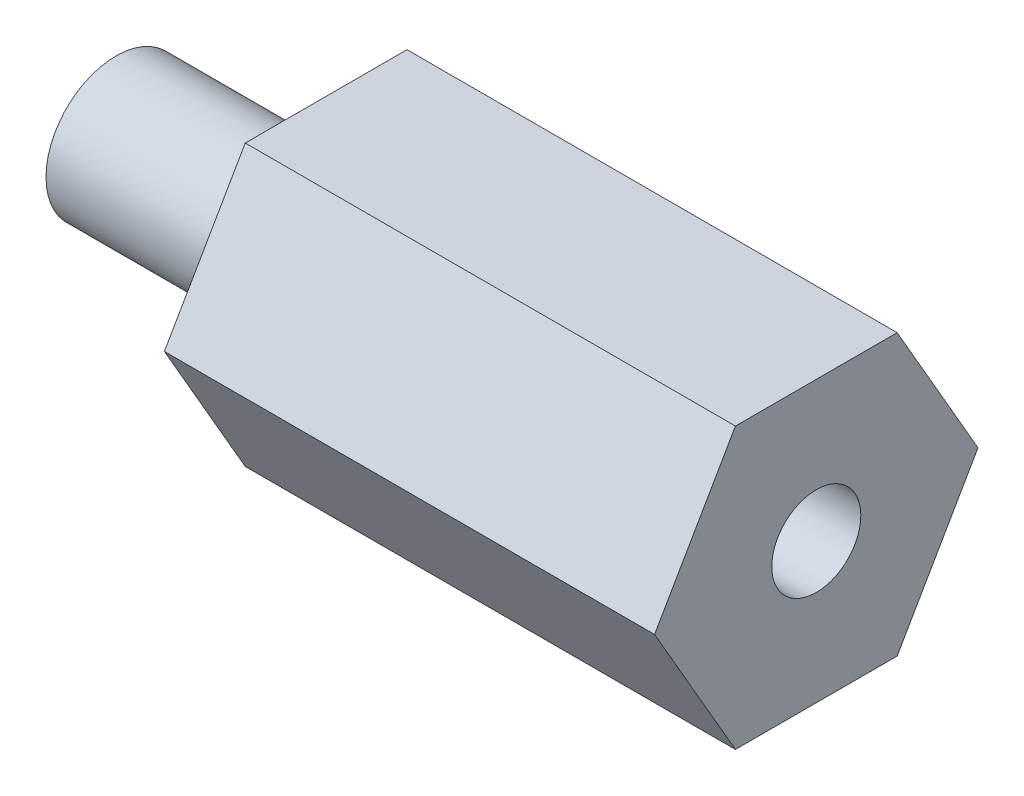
from build123d import *

# Parameters (mm, degrees)
BOSS_EXTRUDE1_DEPTH        = 31.75
F_10_32_TAPPED_HOLE1_D     = 4.0386
F_10_32_TAPPED_HOLE1_DEPTH = 12.7
F_10_32_TAPPED_HOLE1_TIP   = 1.213317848
SKETCH3_R                  = 7.332348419
SKETCH3_R_2                = 3.175
CUT_EXTRUDE1_DEPTH         = 9.525


with BuildPart() as part:
    # Sketch1 → Boss-Extrude1 (new body)
    with BuildSketch(Plane(origin=(0, 0, 0), x_dir=(0, 0, -1), z_dir=(1, 0, 0))):
        Polygon((7.332348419, 0), (3.666174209, 6.35), (-3.666174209, 6.35), (-7.332348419, 0), (-3.666174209, -6.35), (3.666174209, -6.35), align=None)
    extrude(amount=BOSS_EXTRUDE1_DEPTH)

    # 10-32 Tapped Hole1
    with Locations(Plane(origin=(31.75, 0, 0), x_dir=(0, 0, 1), z_dir=(1, 0, 0))):
        with Locations((0, 0)):
            Hole(F_10_32_TAPPED_HOLE1_D / 2, depth=F_10_32_TAPPED_HOLE1_DEPTH)
            with Locations((0, 0, -(F_10_32_TAPPED_HOLE1_DEPTH + F_10_32_TAPPED_HOLE1_TIP / 2))):  # 118° drill point
                Cone(0, F_10_32_TAPPED_HOLE1_D / 2, F_10_32_TAPPED_HOLE1_TIP, mode=Mode.SUBTRACT)

    # Sketch3 → Cut-Extrude1 (cut)
    with BuildSketch(Plane.ZY):
        Circle(SKETCH3_R)
        Circle(SKETCH3_R_2, mode=Mode.SUBTRACT)
    extrude(amount=-CUT_EXTRUDE1_DEPTH, mode=Mode.SUBTRACT)


solid = part.part
